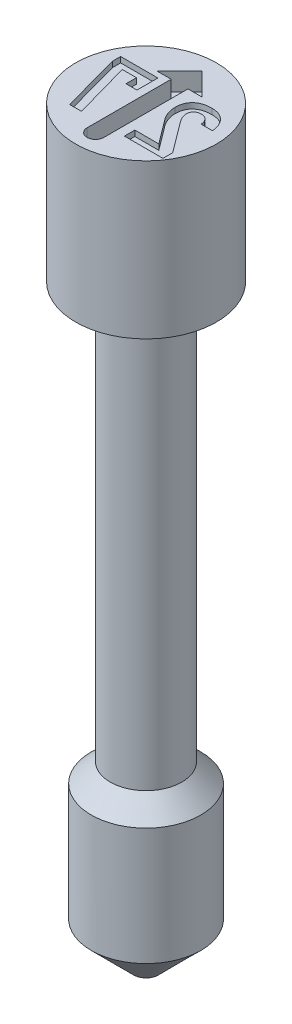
from build123d import *

# Parameters (mm, degrees)
CUT_EXTRUDE1_DEPTH = 0.4064
CUT_EXTRUDE2_DEPTH = 0.127


with BuildPart() as part:
    # Sketch1 → Revolve1 (revolve)
    with BuildSketch(Plane.XY, mode=Mode.PRIVATE) as revolve1_sk:
        Polygon((0, 17.018), (1.6002, 17.018), (1.6002, 13.5128), (0.8128, 13.5128), (0.8128, 4.064), (1.2446, 3.6322), (1.2446, 0.9652), (0.2794, 0), (0, 0), align=None)
    revolve(revolve1_sk.sketch.rotate(Axis((0, 0, 0), (0, 1, 0)), 90), axis=Axis((0, 0, 0), (0, 1, 0)))

    # Sketch2 → Cut-Extrude1 (cut)
    with BuildSketch(Plane(origin=(0, 17.018, 0), x_dir=(1, 0, 0), z_dir=(0, 1, 0))):
        with BuildLine():
            Line((0.1905, -1.149159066), (0.1905, 0.762))
            Line((0.1905, 0.762), (0.508, 0.762))
            Line((0.508, 0.762), (0, 1.27))
            Line((0, 1.27), (-0.508, 0.762))
            Line((-0.508, 0.762), (-0.1905, 0.762))
            Line((-0.1905, 0.762), (-0.1905, -1.149159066))
            ThreePointArc((-0.1905, -1.149159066), (0, -1.339659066), (0.1905, -1.149159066))
        make_face()
    extrude(amount=-CUT_EXTRUDE1_DEPTH, mode=Mode.SUBTRACT)

    # Sketch3 → Cut-Extrude2 (cut)
    with BuildSketch(Plane(origin=(0, 17.018, 0), x_dir=(1, 0, 0), z_dir=(0, 1, 0))):
        with BuildLine():
            Line((1.273448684, -0.889), (1.273448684, -0.669120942))
            Line((1.273448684, -0.669120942), (0.748336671, 0.034739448))
            add(Edge.make_bspline(
                [(0.748336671, 0.034739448), (0.741838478, 0.043736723), (0.729024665, 0.061478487), (0.711877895, 0.089063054), (0.697433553, 0.117291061), (0.684977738, 0.145641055), (0.675221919, 0.173783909), (0.667851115, 0.201124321), (0.663785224, 0.227592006), (0.663038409, 0.24491675), (0.662673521, 0.253381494)],
                knots=[0, 0, 0, 0, 1.116221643, 2.201082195, 3.263105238, 4.303340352, 5.313368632, 6.256511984, 7.148144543, 8, 8, 8, 8], degree=3))
            Line((0.662673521, 0.253381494), (0.662673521, 0.255546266))
            add(Edge.make_bspline(
                [(0.662673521, 0.255546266), (0.663090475, 0.267776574), (0.663887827, 0.291164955), (0.673136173, 0.323903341), (0.687836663, 0.352389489), (0.708798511, 0.375960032), (0.73487876, 0.39471717), (0.766038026, 0.408250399), (0.80210888, 0.415707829), (0.827677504, 0.4167422), (0.841112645, 0.417285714)],
                knots=[0, 0, 0, 0, 1.070617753, 2.047374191, 2.957911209, 3.861726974, 4.788257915, 5.756429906, 6.821106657, 8, 8, 8, 8], degree=3))
            add(Edge.make_bspline(
                [(0.841112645, 0.417285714), (0.853973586, 0.416806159), (0.878876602, 0.415877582), (0.914224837, 0.405385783), (0.946271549, 0.389265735), (0.973885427, 0.365972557), (0.99709423, 0.336937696), (1.01549233, 0.302387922), (1.028373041, 0.262224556), (1.032937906, 0.233466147), (1.035323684, 0.218435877)],
                knots=[0, 0, 0, 0, 0.999891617, 1.936119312, 2.849186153, 3.779495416, 4.728470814, 5.731748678, 6.81452301, 8, 8, 8, 8], degree=3))
            Line((1.035323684, 0.218435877), (1.292003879, 0.217508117))
            add(Edge.make_bspline(
                [(1.292003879, 0.217508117), (1.290025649, 0.235388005), (1.286164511, 0.268475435), (1.275662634, 0.316155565), (1.262813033, 0.360994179), (1.246714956, 0.402932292), (1.227504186, 0.44190957), (1.205609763, 0.478214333), (1.179938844, 0.510974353), (1.151927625, 0.541168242), (1.120857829, 0.56770586), (1.087632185, 0.591036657), (1.052257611, 0.610955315), (1.014619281, 0.62711044), (0.974775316, 0.639408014), (0.932884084, 0.648430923), (0.888768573, 0.653693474), (0.858650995, 0.654420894), (0.843277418, 0.654792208)],
                knots=[0, 0, 0, 0, 1.176458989, 2.296231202, 3.362707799, 4.39127888, 5.389699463, 6.356664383, 7.309489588, 8.255125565, 9.192870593, 10.121896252, 11.051411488, 11.987780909, 12.941242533, 13.922967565, 14.939774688, 16, 16, 16, 16], degree=3))
            add(Edge.make_bspline(
                [(0.843277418, 0.654792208), (0.826254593, 0.654544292), (0.793163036, 0.654062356), (0.745110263, 0.648934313), (0.699975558, 0.641058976), (0.657797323, 0.629685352), (0.618659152, 0.614810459), (0.582524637, 0.596748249), (0.549158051, 0.575762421), (0.519054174, 0.551141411), (0.49217009, 0.52367364), (0.468649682, 0.493460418), (0.449235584, 0.46024052), (0.432539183, 0.424683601), (0.420453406, 0.386017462), (0.411356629, 0.34496658), (0.4061506, 0.301139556), (0.405433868, 0.271022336), (0.405065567, 0.255546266)],
                knots=[0, 0, 0, 0, 1.211483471, 2.355066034, 3.436186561, 4.470562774, 5.460097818, 6.411901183, 7.342329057, 8.260432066, 9.17382984, 10.073682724, 10.9786387, 11.907937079, 12.864144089, 13.855989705, 14.898276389, 16, 16, 16, 16], degree=3))
            add(Edge.make_bspline(
                [(0.405065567, 0.255546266), (0.40547127, 0.23902749), (0.40628614, 0.20771229), (0.413333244, 0.160595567), (0.423509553, 0.11298942), (0.438977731, 0.065580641), (0.457607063, 0.018638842), (0.480321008, -0.026766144), (0.506242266, -0.070768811), (0.526365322, -0.098295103), (0.536498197, -0.112155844)],
                knots=[0, 0, 0, 0, 0.943703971, 1.895468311, 2.880041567, 3.888955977, 4.911454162, 5.936103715, 6.960734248, 8, 8, 8, 8], degree=3))
            Line((0.536498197, -0.112155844), (0.94254771, -0.651493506))
            Line((0.94254771, -0.651493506), (0.396715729, -0.651493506))
            Line((0.396715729, -0.651493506), (0.396715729, -0.889))
            Line((0.396715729, -0.889), (1.273448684, -0.889))
        make_face()
        Polygon((-1.212613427, 0.635), (-1.212613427, 0.446355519), (-0.846148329, -0.889), (-0.578025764, -0.889), (-0.938924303, 0.397493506), (-0.615445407, 0.397493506), (-0.615445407, 0.159987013), (-0.36618729, 0.159987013), (-0.36618729, 0.635), align=None)
    extrude(amount=-CUT_EXTRUDE2_DEPTH, mode=Mode.SUBTRACT)


solid = part.part
